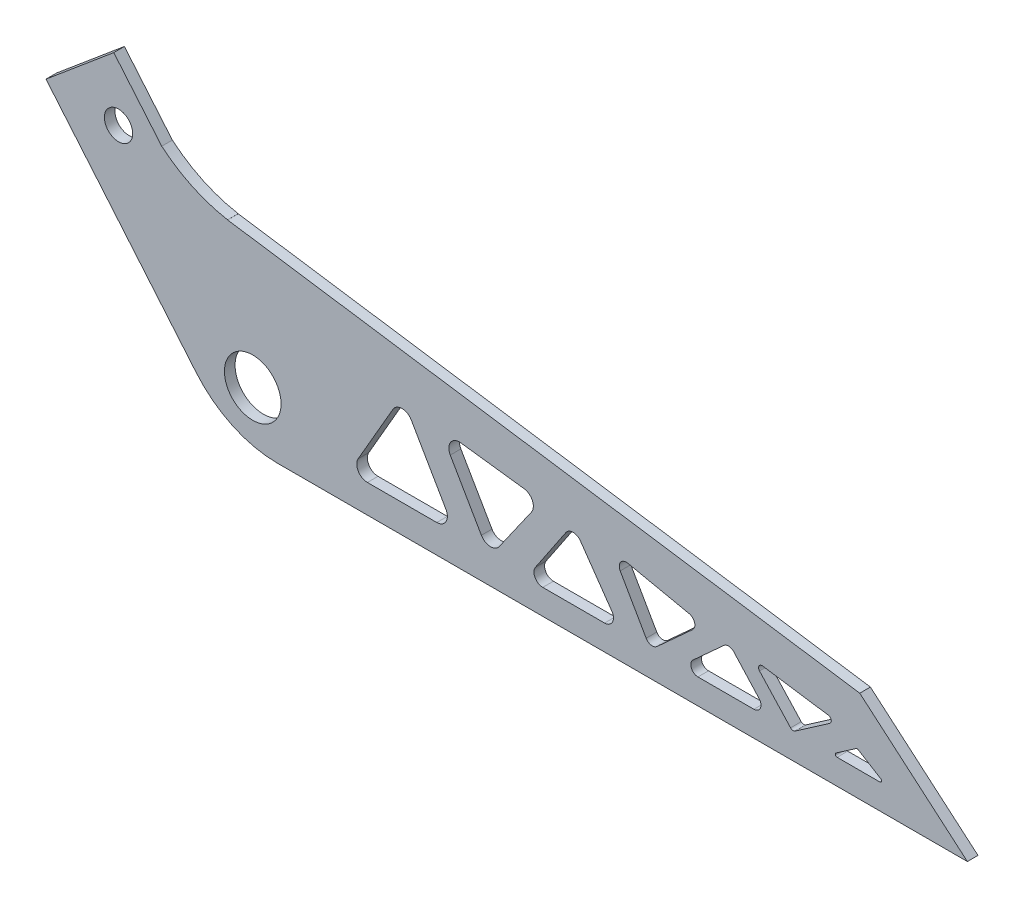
from build123d import *

# Parameters (mm, degrees)
SKETCH1_R           = 4
SKETCH1_R_2         = 8
BOSS_EXTRUDE1_DEPTH = 3


with BuildPart() as part:
    # Sketch1 → Boss-Extrude1 (new body)
    with BuildSketch(Plane.XY):
        with BuildLine():
            Line((0, 0), (19.151111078, 16.069690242))
            Line((19.151111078, 16.069690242), (32.701647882, -0.079210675))
            ThreePointArc((32.701647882, -0.079210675), (41.429226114, -5.654605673), (51.305033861, -8.772950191))
            Line((51.305033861, -8.772950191), (51.30138723, -8.793631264))
            Line((51.30138723, -8.793631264), (229.919548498, -35.291087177))
            Line((229.919548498, -35.291087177), (260.323357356, -61.28355545))
            Line((260.323357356, -61.28355545), (65.41223852, -61.28355545))
            ThreePointArc((65.41223852, -61.28355545), (52.733690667, -58.472789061), (42.430905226, -50.56718374))
            Line((42.430905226, -50.56718374), (0, 0))
        make_face()
        with Locations((20.489693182, -1.082808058)):
            Circle(SKETCH1_R, mode=Mode.SUBTRACT)
        with Locations((58.414162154, -46.279430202)):
            Circle(SKETCH1_R_2, mode=Mode.SUBTRACT)
        with BuildLine():
            Line((90.801355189, -53.28355545), (110.409050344, -53.28355545))
            ThreePointArc((110.409050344, -53.28355545), (113.007126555, -51.78355545), (113.007126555, -48.78355545))
            Line((113.007126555, -48.78355545), (103.203278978, -31.802793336))
            ThreePointArc((103.203278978, -31.802793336), (100.605202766, -30.302793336), (98.007126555, -31.802793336))
            Line((98.007126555, -31.802793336), (88.203278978, -48.78355545))
            ThreePointArc((88.203278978, -48.78355545), (88.203278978, -51.78355545), (90.801355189, -53.28355545))
        make_face(mode=Mode.SUBTRACT)
        with BuildLine():
            Line((114.216704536, -34.878605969), (123.006760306, -50.103429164))
            ThreePointArc((123.006760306, -50.103429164), (125.472993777, -51.600530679), (128.061161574, -50.325772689))
            Line((128.061161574, -50.325772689), (137.142966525, -37.373731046))
            ThreePointArc((137.142966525, -37.373731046), (137.430305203, -34.437999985), (135.065106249, -32.675355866))
            Line((135.065106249, -32.675355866), (117.193245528, -30.402574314))
            ThreePointArc((117.193245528, -30.402574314), (114.316704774, -31.717396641), (114.216704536, -34.878605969))
        make_face(mode=Mode.SUBTRACT)
        with BuildLine():
            Line((140.362734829, -54.178637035), (157.825672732, -54.178637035))
            ThreePointArc((157.825672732, -54.178637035), (160.041790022, -52.835712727), (159.87704509, -50.249696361))
            Line((159.87704509, -50.249696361), (150.992093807, -37.494552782))
            ThreePointArc((150.992093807, -37.494552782), (148.920237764, -36.423577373), (146.866209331, -37.528359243))
            Line((146.866209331, -37.528359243), (138.288222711, -50.283502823))
            ThreePointArc((138.288222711, -50.283502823), (138.156172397, -52.853831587), (140.362734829, -54.178637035))
        make_face(mode=Mode.SUBTRACT)
        with BuildLine():
            Line((162.227076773, -39.20828552), (169.563014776, -52.016086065))
            ThreePointArc((169.563014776, -52.016086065), (170.987532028, -52.99772966), (172.644718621, -52.501135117))
            Line((172.644718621, -52.501135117), (182.67432136, -43.372455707))
            ThreePointArc((182.67432136, -43.372455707), (183.258380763, -41.36991011), (181.742624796, -39.936802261))
            Line((181.742624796, -39.936802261), (164.377084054, -36.257681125))
            ThreePointArc((164.377084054, -36.257681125), (162.346158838, -37.036435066), (162.227076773, -39.20828552))
        make_face(mode=Mode.SUBTRACT)
        with BuildLine():
            Line((184.189376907, -54.178637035), (200.007119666, -54.178637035))
            ThreePointArc((200.007119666, -54.178637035), (201.836387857, -52.987202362), (201.486202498, -50.832414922))
            Line((201.486202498, -50.832414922), (194.319523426, -42.958445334))
            ThreePointArc((194.319523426, -42.958445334), (192.934387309, -42.306875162), (191.494218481, -42.825584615))
            Line((191.494218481, -42.825584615), (182.843154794, -50.699554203))
            ThreePointArc((182.843154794, -50.699554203), (182.324146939, -52.900382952), (184.189376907, -54.178637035))
        make_face(mode=Mode.SUBTRACT)
        with BuildLine():
            Line((210.371148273, -53.539300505), (201.593510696, -44.022631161))
            ThreePointArc((201.593510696, -44.022631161), (201.444662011, -42.877005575), (202.475506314, -42.355494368))
            Line((202.475506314, -42.355494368), (221.013850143, -45.109095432))
            ThreePointArc((221.013850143, -45.109095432), (221.840766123, -45.87100631), (221.436458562, -46.920212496))
            Line((221.436458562, -46.920212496), (211.67575231, -53.683280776))
            ThreePointArc((211.67575231, -53.683280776), (210.996523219, -53.855276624), (210.371148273, -53.539300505))
        make_face(mode=Mode.SUBTRACT)
        with BuildLine():
            Line((223.227204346, -53.267652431), (228.891360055, -49.343031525))
            ThreePointArc((228.891360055, -49.343031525), (229.161905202, -49.254218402), (229.437062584, -49.327504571))
            Line((229.437062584, -49.327504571), (235.852017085, -53.252125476))
            ThreePointArc((235.852017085, -53.252125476), (236.072357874, -53.814180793), (235.591080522, -54.178637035))
            Line((235.591080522, -54.178637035), (223.511970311, -54.178637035))
            ThreePointArc((223.511970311, -54.178637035), (223.034742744, -53.827814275), (223.227204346, -53.267652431))
        make_face(mode=Mode.SUBTRACT)
    extrude(amount=BOSS_EXTRUDE1_DEPTH)


solid = part.part
